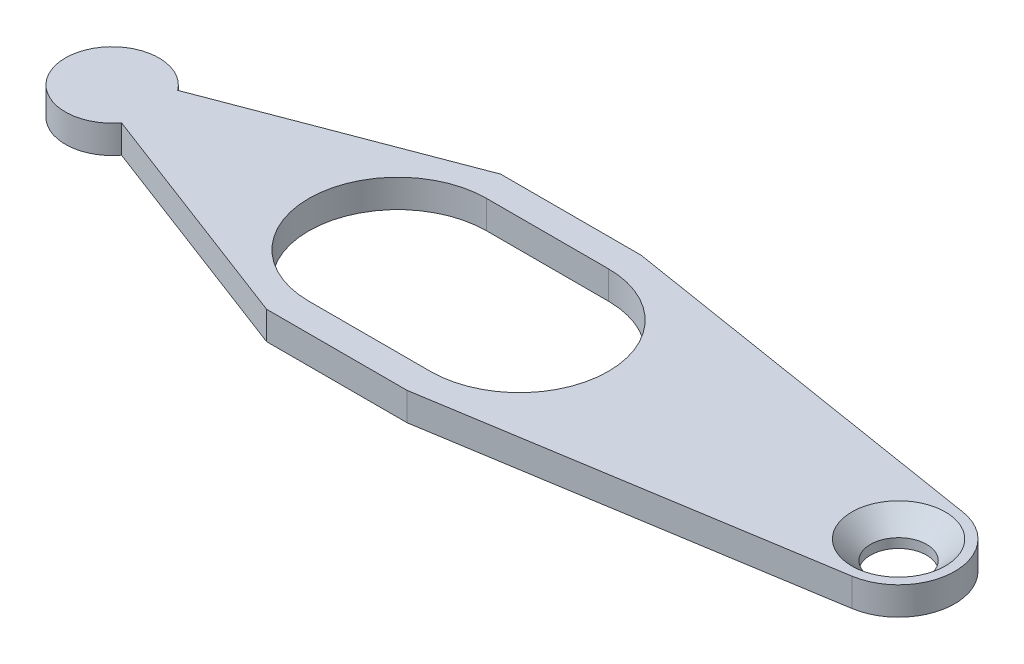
from build123d import *

# Parameters (mm, degrees)
EXTRUDE1_DEPTH = 3


with BuildPart() as part:
    # Sketch1 → Extrude1 (new body)
    with BuildSketch(Plane(origin=(0, 0, 0), x_dir=(1, 0, 0), z_dir=(0, 1, 0))):
        with BuildLine():
            Line((4, 3), (29, 12.5))
            Line((29, 12.5), (44, 12.5))
            Line((44, 12.5), (84.951283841, 5.924108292))
            ThreePointArc((84.951283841, 5.924108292), (90, 0), (84.951283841, -5.924108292))
            Line((84.951283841, -5.924108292), (44, -12.5))
            Line((44, -12.5), (29, -12.5))
            Line((29, -12.5), (4, -3))
            ThreePointArc((4, -3), (-5, 0), (4, 3))
        make_face()
        with BuildLine():
            Line((30.5, 9.5), (43.5, 9.5))
            ThreePointArc((43.5, 9.5), (53, 0), (43.5, -9.5))
            Line((43.5, -9.5), (30.5, -9.5))
            ThreePointArc((30.5, -9.5), (21, 0), (30.5, 9.5))
        make_face(mode=Mode.SUBTRACT)
    extrude(amount=EXTRUDE1_DEPTH)

    # Sketch3 → CSK for M6 Countersunk Flat Head Screw1 (revolve, cut)
    with BuildSketch(Plane(origin=(84, 3, 0), x_dir=(0, 0, 1), z_dir=(1, 0, 0))):
        Polygon((0, 0), (0, 3), (3, 3), (3, 2), (5, 0), align=None)
    revolve(axis=Axis((84, 9.35, 0), (0, -1, 0)), mode=Mode.SUBTRACT)


solid = part.part
